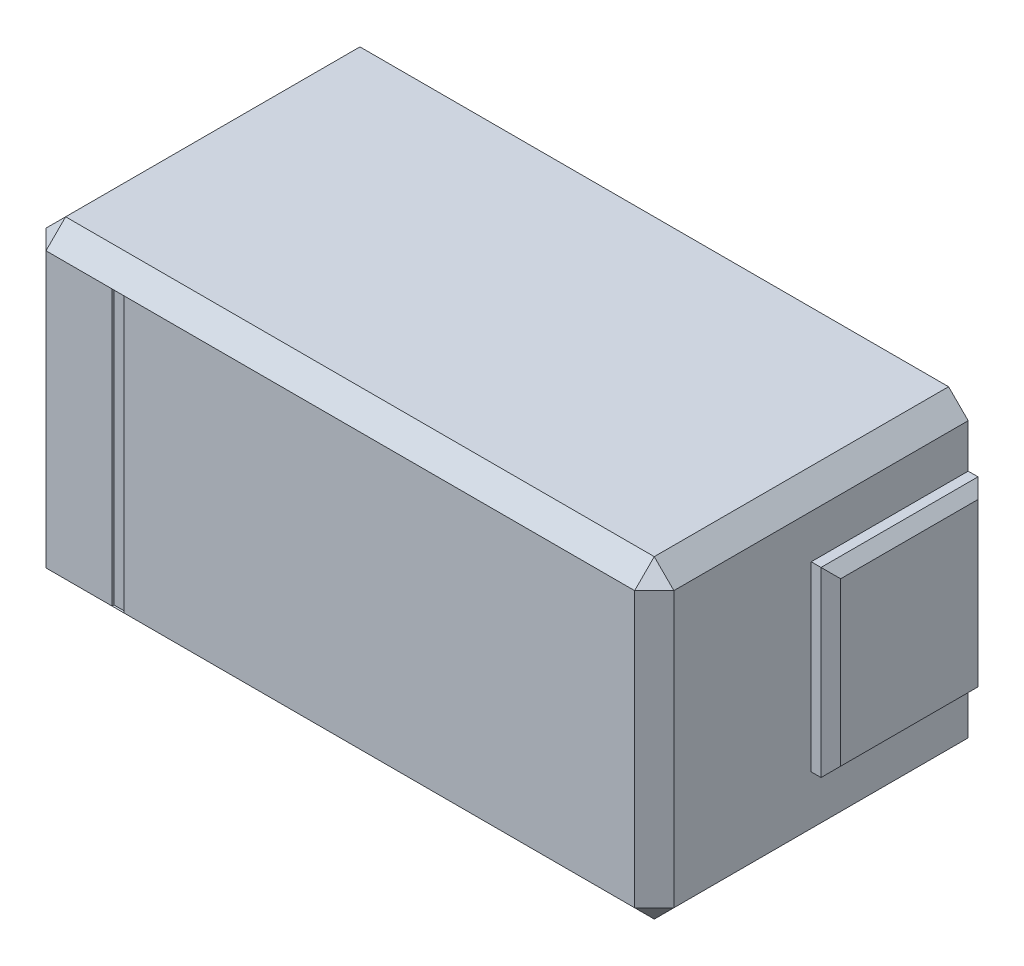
from build123d import *

# Parameters (mm, degrees)
SKETCH1_W           = 3.2
SKETCH1_H           = 1.6
BASE_EXTRUDE_DEPTH  = 1.6
SKETCH2_W           = 0.75
SKETCH2_H           = 1
BOSS_EXTRUDE1_DEPTH = 0.1
SKETCH3_W           = 0.8
SKETCH3_H           = 0.927317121
BOSS_EXTRUDE2_DEPTH = 0.1
CHAMFER1_SIZE       = 0.1
CHAMFER2_SIZE       = 0.05
SKETCH4_W           = 0.062440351
SKETCH4_H           = 1.4
CUT_EXTRUDE1_DEPTH  = 0.01


with BuildPart() as part:
    # Sketch1 → Base-Extrude (new body)
    with BuildSketch(Plane.XY):
        with Locations((1.6, 0.8)):
            Rectangle(SKETCH1_W, SKETCH1_H)
    extrude(amount=BASE_EXTRUDE_DEPTH)

    # Sketch2 → Boss-Extrude1 (add)
    with BuildSketch(Plane.ZY):
        with Locations((0.375, 0.8)):
            Rectangle(SKETCH2_W, SKETCH2_H)
    extrude(amount=BOSS_EXTRUDE1_DEPTH)

    # Sketch3 → Boss-Extrude2 (add)
    with BuildSketch(Plane(origin=(3.2, 0, 0), x_dir=(0, 0, -1), z_dir=(1, 0, 0))):
        with Locations((-0.4, 0.813658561)):
            Rectangle(SKETCH3_W, SKETCH3_H)
    extrude(amount=BOSS_EXTRUDE2_DEPTH)

    # Chamfer1
    chamfer1_edges = [part.edges().sort_by_distance(p)[0] for p in [
        (0, 0, 0.8),
        (3.2, 0, 0.8),
        (1.6, 0, 1.6),
        (0, 0.8, 1.6),
        (0, 1.6, 0.8),
        (3.2, 1.6, 0.8),
        (3.2, 0.8, 1.6),
        (1.6, 1.6, 1.6),
    ]]
    chamfer(chamfer1_edges, length=CHAMFER1_SIZE)

    # Chamfer2
    chamfer2_edges = [part.edges().sort_by_distance(p)[0] for p in [
        (-0.1, 0.8, 0),
        (3.3, 0.81365856, 0),
        (-0.1, 0.3, 0.375),
        (3.3, 0.35, 0.4),
        (-0.1, 1.3, 0.375),
        (-0.1, 0.8, 0.75),
        (3.3, 1.277317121, 0.4),
        (3.3, 0.81365856, 0.8),
    ]]
    chamfer(chamfer2_edges, length=CHAMFER2_SIZE)

    # Sketch4 → Cut-Extrude1 (cut)
    with BuildSketch(Plane.XY.offset(1.6)):
        with Locations((0.467559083, 0.8)):
            Rectangle(SKETCH4_W, SKETCH4_H)
    extrude(amount=-CUT_EXTRUDE1_DEPTH, mode=Mode.SUBTRACT)


solid = part.part
